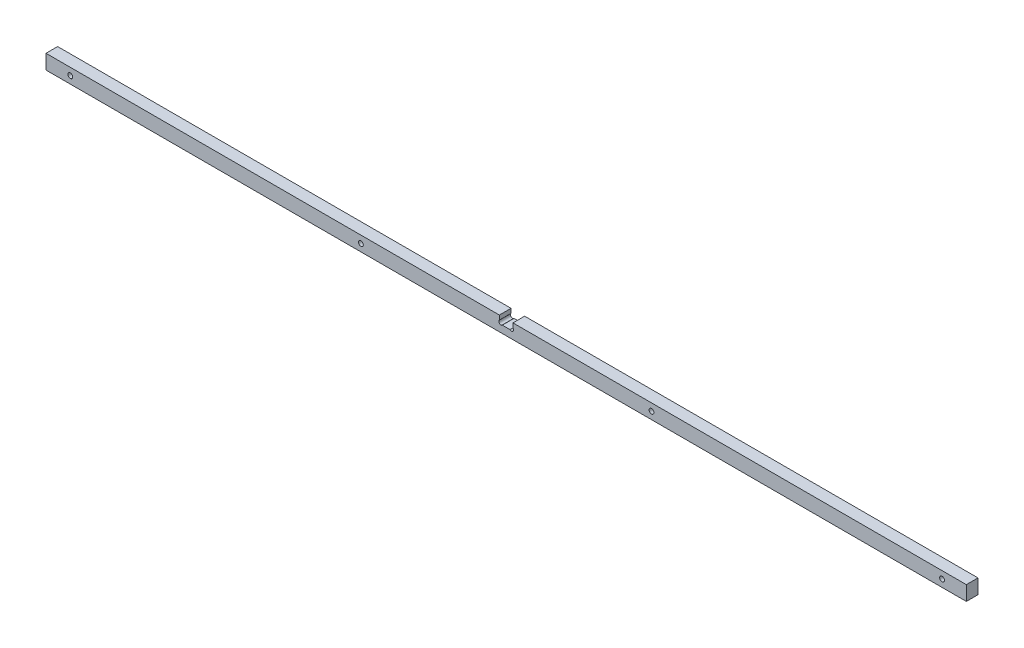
from build123d import *

# Parameters (mm, degrees)
SKETCH_1_W          = 1895
SKETCH_1_H          = 30
SKETCH_1_R          = 5
EXTRUDE_1_DEPTH     = 24
CUT_EXTRUDE_1_DEPTH = 948.922597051


with BuildPart() as part:
    # Sketch 1 → Extrude 1 (new body)
    with BuildSketch(Plane.XY):
        Rectangle(SKETCH_1_W, SKETCH_1_H)
        with Locations((897.5, 0)):
            Circle(SKETCH_1_R, mode=Mode.SUBTRACT)
        with Locations((-897.5, 0)):
            Circle(SKETCH_1_R, mode=Mode.SUBTRACT)
        with Locations((-299.166666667, 0)):
            Circle(SKETCH_1_R, mode=Mode.SUBTRACT)
        with Locations((299.166666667, 0)):
            Circle(SKETCH_1_R, mode=Mode.SUBTRACT)
    extrude(amount=EXTRUDE_1_DEPTH)

    # Sketch 2 → Cut-Extrude 1 (cut, through all)
    with BuildSketch(Plane.XY.offset(24)):
        with BuildLine():
            Line((-14, 15), (14, 15))
            Line((14, 15), (14, 6.010398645))
            ThreePointArc((14, 6.010398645), (14.00520382, -0.00520382), (7.989601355, 0))
            Line((7.989601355, 0), (-7.989601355, 0))
            ThreePointArc((-7.989601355, 0), (-14.00520382, -0.00520382), (-14, 6.010398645))
            Line((-14, 6.010398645), (-14, 15))
        make_face()
    extrude(amount=-CUT_EXTRUDE_1_DEPTH, mode=Mode.SUBTRACT)


solid = part.part
